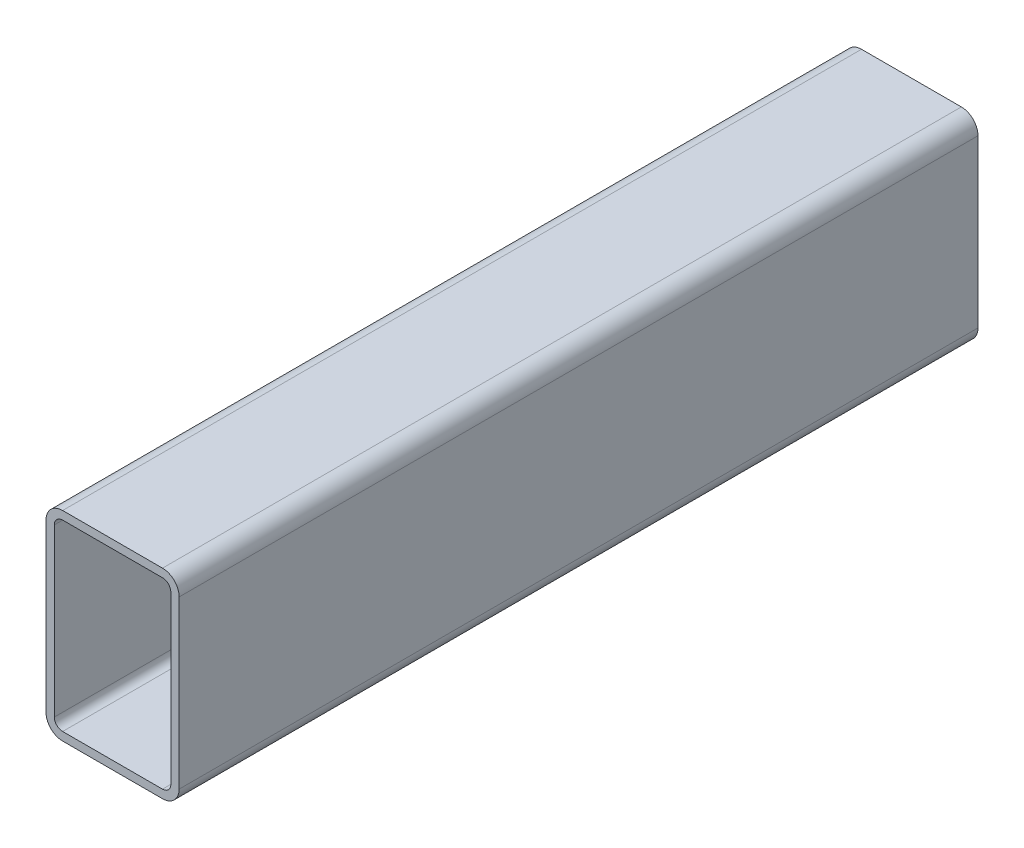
ISO-10303-21;
HEADER;
FILE_DESCRIPTION(('STEP AP214'),'2;1');
FILE_NAME('part.step','',(''),(''),'','','');
FILE_SCHEMA(('AUTOMOTIVE_DESIGN { 1 0 10303 214 1 1 1 1 }'));
ENDSEC;
DATA;
#1=APPLICATION_CONTEXT('core data for automotive mechanical design processes');
#2=APPLICATION_PROTOCOL_DEFINITION('international standard','automotive_design',2000,#1);
#3=PRODUCT_CONTEXT('',#1,'mechanical');
#4=PRODUCT('Part','Part','',(#3));
#5=PRODUCT_RELATED_PRODUCT_CATEGORY('part','',(#4));
#6=PRODUCT_DEFINITION_FORMATION('','',#4);
#7=PRODUCT_DEFINITION_CONTEXT('part definition',#1,'design');
#8=PRODUCT_DEFINITION('design','',#6,#7);
#9=PRODUCT_DEFINITION_SHAPE('','',#8);
#10=(LENGTH_UNIT() NAMED_UNIT(*) SI_UNIT(.MILLI.,.METRE.));
#11=(NAMED_UNIT(*) PLANE_ANGLE_UNIT() SI_UNIT($,.RADIAN.));
#12=(NAMED_UNIT(*) SI_UNIT($,.STERADIAN.) SOLID_ANGLE_UNIT());
#13=UNCERTAINTY_MEASURE_WITH_UNIT(LENGTH_MEASURE(1.E-05),#10,'distance_accuracy_value','');
#14=(GEOMETRIC_REPRESENTATION_CONTEXT(3) GLOBAL_UNCERTAINTY_ASSIGNED_CONTEXT((#13)) GLOBAL_UNIT_ASSIGNED_CONTEXT((#10,
#11,#12)) REPRESENTATION_CONTEXT('',''));
#15=CARTESIAN_POINT('',(0.,0.,0.));
#16=DIRECTION('',(0.,0.,1.));
#17=DIRECTION('',(1.,0.,0.));
#18=AXIS2_PLACEMENT_3D('',#15,#16,#17);
#19=CARTESIAN_POINT('',(6.35,69.85,304.8));
#20=DIRECTION('',(0.,0.,1.));
#21=DIRECTION('',(1.,0.,0.));
#22=AXIS2_PLACEMENT_3D('',#19,#20,#21);
#23=PLANE('',#22);
#24=CARTESIAN_POINT('',(6.35,69.85,304.8));
#25=DIRECTION('',(0.,0.,1.));
#26=DIRECTION('',(1.,0.,0.));
#27=AXIS2_PLACEMENT_3D('',#24,#25,#26);
#28=CIRCLE('',#27,6.35);
#29=CARTESIAN_POINT('',(6.35,76.2,304.8));
#30=VERTEX_POINT('',#29);
#31=CARTESIAN_POINT('',(0.,69.85,304.8));
#32=VERTEX_POINT('',#31);
#33=EDGE_CURVE('E211',#30,#32,#28,.T.);
#34=ORIENTED_EDGE('',*,*,#33,.T.);
#35=DIRECTION('',(0.,-1.,0.));
#36=VECTOR('',#35,1.);
#37=CARTESIAN_POINT('',(0.,6.35,304.8));
#38=LINE('',#37,#36);
#39=CARTESIAN_POINT('',(0.,6.35,304.8));
#40=VERTEX_POINT('',#39);
#41=EDGE_CURVE('E214',#32,#40,#38,.T.);
#42=ORIENTED_EDGE('',*,*,#41,.T.);
#43=CARTESIAN_POINT('',(6.35,6.35,304.8));
#44=DIRECTION('',(0.,0.,1.));
#45=DIRECTION('',(1.,0.,0.));
#46=AXIS2_PLACEMENT_3D('',#43,#44,#45);
#47=CIRCLE('',#46,6.35);
#48=CARTESIAN_POINT('',(6.35,0.,304.8));
#49=VERTEX_POINT('',#48);
#50=EDGE_CURVE('E217',#40,#49,#47,.T.);
#51=ORIENTED_EDGE('',*,*,#50,.T.);
#52=DIRECTION('',(1.,0.,0.));
#53=VECTOR('',#52,1.);
#54=CARTESIAN_POINT('',(44.45,0.,304.8));
#55=LINE('',#54,#53);
#56=CARTESIAN_POINT('',(44.45,0.,304.8));
#57=VERTEX_POINT('',#56);
#58=EDGE_CURVE('E219',#49,#57,#55,.T.);
#59=ORIENTED_EDGE('',*,*,#58,.T.);
#60=CARTESIAN_POINT('',(44.45,6.35,304.8));
#61=DIRECTION('',(0.,0.,1.));
#62=DIRECTION('',(1.,0.,0.));
#63=AXIS2_PLACEMENT_3D('',#60,#61,#62);
#64=CIRCLE('',#63,6.35);
#65=CARTESIAN_POINT('',(50.8,6.35,304.8));
#66=VERTEX_POINT('',#65);
#67=EDGE_CURVE('E221',#57,#66,#64,.T.);
#68=ORIENTED_EDGE('',*,*,#67,.T.);
#69=DIRECTION('',(0.,1.,0.));
#70=VECTOR('',#69,1.);
#71=CARTESIAN_POINT('',(50.8,69.85,304.8));
#72=LINE('',#71,#70);
#73=CARTESIAN_POINT('',(50.8,69.85,304.8));
#74=VERTEX_POINT('',#73);
#75=EDGE_CURVE('E223',#66,#74,#72,.T.);
#76=ORIENTED_EDGE('',*,*,#75,.T.);
#77=CARTESIAN_POINT('',(44.45,69.85,304.8));
#78=DIRECTION('',(0.,0.,1.));
#79=DIRECTION('',(1.,0.,0.));
#80=AXIS2_PLACEMENT_3D('',#77,#78,#79);
#81=CIRCLE('',#80,6.35000000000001);
#82=CARTESIAN_POINT('',(44.45,76.2,304.8));
#83=VERTEX_POINT('',#82);
#84=EDGE_CURVE('E225',#74,#83,#81,.T.);
#85=ORIENTED_EDGE('',*,*,#84,.T.);
#86=DIRECTION('',(-1.,0.,0.));
#87=VECTOR('',#86,1.);
#88=CARTESIAN_POINT('',(6.35,76.2,304.8));
#89=LINE('',#88,#87);
#90=EDGE_CURVE('E227',#83,#30,#89,.T.);
#91=ORIENTED_EDGE('',*,*,#90,.T.);
#92=EDGE_LOOP('',(#34,#42,#51,#59,#68,#76,#85,#91));
#93=FACE_BOUND('',#92,.T.);
#94=DIRECTION('',(0.,-1.,0.));
#95=VECTOR('',#94,1.);
#96=CARTESIAN_POINT('',(3.175,6.35,304.8));
#97=LINE('',#96,#95);
#98=CARTESIAN_POINT('',(3.175,69.85,304.8));
#99=VERTEX_POINT('',#98);
#100=CARTESIAN_POINT('',(3.175,6.35,304.8));
#101=VERTEX_POINT('',#100);
#102=EDGE_CURVE('E154',#99,#101,#97,.T.);
#103=ORIENTED_EDGE('',*,*,#102,.F.);
#104=CARTESIAN_POINT('',(6.35,69.85,304.8));
#105=DIRECTION('',(0.,0.,1.));
#106=DIRECTION('',(1.,0.,0.));
#107=AXIS2_PLACEMENT_3D('',#104,#105,#106);
#108=CIRCLE('',#107,3.175);
#109=CARTESIAN_POINT('',(6.35,73.025,304.8));
#110=VERTEX_POINT('',#109);
#111=EDGE_CURVE('E146',#110,#99,#108,.T.);
#112=ORIENTED_EDGE('',*,*,#111,.F.);
#113=DIRECTION('',(-1.,0.,0.));
#114=VECTOR('',#113,1.);
#115=CARTESIAN_POINT('',(6.35,73.025,304.8));
#116=LINE('',#115,#114);
#117=CARTESIAN_POINT('',(44.45,73.025,304.8));
#118=VERTEX_POINT('',#117);
#119=EDGE_CURVE('E179',#118,#110,#116,.T.);
#120=ORIENTED_EDGE('',*,*,#119,.F.);
#121=CARTESIAN_POINT('',(44.45,69.85,304.8));
#122=DIRECTION('',(0.,0.,1.));
#123=DIRECTION('',(1.,0.,0.));
#124=AXIS2_PLACEMENT_3D('',#121,#122,#123);
#125=CIRCLE('',#124,3.175);
#126=CARTESIAN_POINT('',(47.625,69.85,304.8));
#127=VERTEX_POINT('',#126);
#128=EDGE_CURVE('E177',#127,#118,#125,.T.);
#129=ORIENTED_EDGE('',*,*,#128,.F.);
#130=DIRECTION('',(0.,1.,0.));
#131=VECTOR('',#130,1.);
#132=CARTESIAN_POINT('',(47.625,69.85,304.8));
#133=LINE('',#132,#131);
#134=CARTESIAN_POINT('',(47.625,6.35,304.8));
#135=VERTEX_POINT('',#134);
#136=EDGE_CURVE('E175',#135,#127,#133,.T.);
#137=ORIENTED_EDGE('',*,*,#136,.F.);
#138=CARTESIAN_POINT('',(44.45,6.35,304.8));
#139=DIRECTION('',(0.,0.,1.));
#140=DIRECTION('',(1.,0.,0.));
#141=AXIS2_PLACEMENT_3D('',#138,#139,#140);
#142=CIRCLE('',#141,3.175);
#143=CARTESIAN_POINT('',(44.45,3.175,304.8));
#144=VERTEX_POINT('',#143);
#145=EDGE_CURVE('E173',#144,#135,#142,.T.);
#146=ORIENTED_EDGE('',*,*,#145,.F.);
#147=DIRECTION('',(1.,0.,0.));
#148=VECTOR('',#147,1.);
#149=CARTESIAN_POINT('',(44.45,3.175,304.8));
#150=LINE('',#149,#148);
#151=CARTESIAN_POINT('',(6.35,3.175,304.8));
#152=VERTEX_POINT('',#151);
#153=EDGE_CURVE('E169',#152,#144,#150,.T.);
#154=ORIENTED_EDGE('',*,*,#153,.F.);
#155=CARTESIAN_POINT('',(6.35,6.35,304.8));
#156=DIRECTION('',(0.,0.,1.));
#157=DIRECTION('',(1.,0.,0.));
#158=AXIS2_PLACEMENT_3D('',#155,#156,#157);
#159=CIRCLE('',#158,3.175);
#160=EDGE_CURVE('E167',#101,#152,#159,.T.);
#161=ORIENTED_EDGE('',*,*,#160,.F.);
#162=EDGE_LOOP('',(#103,#112,#120,#129,#137,#146,#154,#161));
#163=FACE_BOUND('',#162,.T.);
#164=ADVANCED_FACE('F33',(#93,#163),#23,.T.);
#165=CARTESIAN_POINT('',(6.35,69.85,0.));
#166=DIRECTION('',(0.,0.,1.));
#167=DIRECTION('',(1.,0.,0.));
#168=AXIS2_PLACEMENT_3D('',#165,#166,#167);
#169=PLANE('',#168);
#170=CARTESIAN_POINT('',(6.35,69.85,0.));
#171=DIRECTION('',(0.,0.,1.));
#172=DIRECTION('',(1.,0.,0.));
#173=AXIS2_PLACEMENT_3D('',#170,#171,#172);
#174=CIRCLE('',#173,6.35);
#175=CARTESIAN_POINT('',(6.35,76.2,0.));
#176=VERTEX_POINT('',#175);
#177=CARTESIAN_POINT('',(0.,69.85,0.));
#178=VERTEX_POINT('',#177);
#179=EDGE_CURVE('E162',#176,#178,#174,.T.);
#180=ORIENTED_EDGE('',*,*,#179,.F.);
#181=DIRECTION('',(-1.,0.,0.));
#182=VECTOR('',#181,1.);
#183=CARTESIAN_POINT('',(6.35,76.2,0.));
#184=LINE('',#183,#182);
#185=CARTESIAN_POINT('',(44.45,76.2,0.));
#186=VERTEX_POINT('',#185);
#187=EDGE_CURVE('E215',#186,#176,#184,.T.);
#188=ORIENTED_EDGE('',*,*,#187,.F.);
#189=CARTESIAN_POINT('',(44.45,69.85,0.));
#190=DIRECTION('',(0.,0.,1.));
#191=DIRECTION('',(1.,0.,0.));
#192=AXIS2_PLACEMENT_3D('',#189,#190,#191);
#193=CIRCLE('',#192,6.35000000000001);
#194=CARTESIAN_POINT('',(50.8,69.85,0.));
#195=VERTEX_POINT('',#194);
#196=EDGE_CURVE('E242',#195,#186,#193,.T.);
#197=ORIENTED_EDGE('',*,*,#196,.F.);
#198=DIRECTION('',(0.,1.,0.));
#199=VECTOR('',#198,1.);
#200=CARTESIAN_POINT('',(50.8,69.85,0.));
#201=LINE('',#200,#199);
#202=CARTESIAN_POINT('',(50.8,6.35,0.));
#203=VERTEX_POINT('',#202);
#204=EDGE_CURVE('E240',#203,#195,#201,.T.);
#205=ORIENTED_EDGE('',*,*,#204,.F.);
#206=CARTESIAN_POINT('',(44.45,6.35,0.));
#207=DIRECTION('',(0.,0.,1.));
#208=DIRECTION('',(1.,0.,0.));
#209=AXIS2_PLACEMENT_3D('',#206,#207,#208);
#210=CIRCLE('',#209,6.35);
#211=CARTESIAN_POINT('',(44.45,0.,0.));
#212=VERTEX_POINT('',#211);
#213=EDGE_CURVE('E238',#212,#203,#210,.T.);
#214=ORIENTED_EDGE('',*,*,#213,.F.);
#215=DIRECTION('',(1.,0.,0.));
#216=VECTOR('',#215,1.);
#217=CARTESIAN_POINT('',(44.45,0.,0.));
#218=LINE('',#217,#216);
#219=CARTESIAN_POINT('',(6.35,0.,0.));
#220=VERTEX_POINT('',#219);
#221=EDGE_CURVE('E236',#220,#212,#218,.T.);
#222=ORIENTED_EDGE('',*,*,#221,.F.);
#223=CARTESIAN_POINT('',(6.35,6.35,0.));
#224=DIRECTION('',(0.,0.,1.));
#225=DIRECTION('',(1.,0.,0.));
#226=AXIS2_PLACEMENT_3D('',#223,#224,#225);
#227=CIRCLE('',#226,6.35);
#228=CARTESIAN_POINT('',(0.,6.35,0.));
#229=VERTEX_POINT('',#228);
#230=EDGE_CURVE('E234',#229,#220,#227,.T.);
#231=ORIENTED_EDGE('',*,*,#230,.F.);
#232=DIRECTION('',(0.,-1.,0.));
#233=VECTOR('',#232,1.);
#234=CARTESIAN_POINT('',(0.,6.35,0.));
#235=LINE('',#234,#233);
#236=EDGE_CURVE('E232',#178,#229,#235,.T.);
#237=ORIENTED_EDGE('',*,*,#236,.F.);
#238=EDGE_LOOP('',(#180,#188,#197,#205,#214,#222,#231,#237));
#239=FACE_BOUND('',#238,.T.);
#240=CARTESIAN_POINT('',(6.35,69.85,0.));
#241=DIRECTION('',(0.,0.,1.));
#242=DIRECTION('',(1.,0.,0.));
#243=AXIS2_PLACEMENT_3D('',#240,#241,#242);
#244=CIRCLE('',#243,3.175);
#245=CARTESIAN_POINT('',(6.35,73.025,0.));
#246=VERTEX_POINT('',#245);
#247=CARTESIAN_POINT('',(3.175,69.85,0.));
#248=VERTEX_POINT('',#247);
#249=EDGE_CURVE('E56',#246,#248,#244,.T.);
#250=ORIENTED_EDGE('',*,*,#249,.T.);
#251=DIRECTION('',(0.,-1.,0.));
#252=VECTOR('',#251,1.);
#253=CARTESIAN_POINT('',(3.175,6.35,0.));
#254=LINE('',#253,#252);
#255=CARTESIAN_POINT('',(3.175,6.35,0.));
#256=VERTEX_POINT('',#255);
#257=EDGE_CURVE('E161',#248,#256,#254,.T.);
#258=ORIENTED_EDGE('',*,*,#257,.T.);
#259=CARTESIAN_POINT('',(6.35,6.35,0.));
#260=DIRECTION('',(0.,0.,1.));
#261=DIRECTION('',(1.,0.,0.));
#262=AXIS2_PLACEMENT_3D('',#259,#260,#261);
#263=CIRCLE('',#262,3.175);
#264=CARTESIAN_POINT('',(6.35,3.175,0.));
#265=VERTEX_POINT('',#264);
#266=EDGE_CURVE('E183',#256,#265,#263,.T.);
#267=ORIENTED_EDGE('',*,*,#266,.T.);
#268=DIRECTION('',(1.,0.,0.));
#269=VECTOR('',#268,1.);
#270=CARTESIAN_POINT('',(44.45,3.175,0.));
#271=LINE('',#270,#269);
#272=CARTESIAN_POINT('',(44.45,3.175,0.));
#273=VERTEX_POINT('',#272);
#274=EDGE_CURVE('E186',#265,#273,#271,.T.);
#275=ORIENTED_EDGE('',*,*,#274,.T.);
#276=CARTESIAN_POINT('',(44.45,6.35,0.));
#277=DIRECTION('',(0.,0.,1.));
#278=DIRECTION('',(1.,0.,0.));
#279=AXIS2_PLACEMENT_3D('',#276,#277,#278);
#280=CIRCLE('',#279,3.175);
#281=CARTESIAN_POINT('',(47.625,6.35,0.));
#282=VERTEX_POINT('',#281);
#283=EDGE_CURVE('E189',#273,#282,#280,.T.);
#284=ORIENTED_EDGE('',*,*,#283,.T.);
#285=DIRECTION('',(0.,1.,0.));
#286=VECTOR('',#285,1.);
#287=CARTESIAN_POINT('',(47.625,69.85,0.));
#288=LINE('',#287,#286);
#289=CARTESIAN_POINT('',(47.625,69.85,0.));
#290=VERTEX_POINT('',#289);
#291=EDGE_CURVE('E192',#282,#290,#288,.T.);
#292=ORIENTED_EDGE('',*,*,#291,.T.);
#293=CARTESIAN_POINT('',(44.45,69.85,0.));
#294=DIRECTION('',(0.,0.,1.));
#295=DIRECTION('',(1.,0.,0.));
#296=AXIS2_PLACEMENT_3D('',#293,#294,#295);
#297=CIRCLE('',#296,3.175);
#298=CARTESIAN_POINT('',(44.45,73.025,0.));
#299=VERTEX_POINT('',#298);
#300=EDGE_CURVE('E195',#290,#299,#297,.T.);
#301=ORIENTED_EDGE('',*,*,#300,.T.);
#302=DIRECTION('',(-1.,0.,0.));
#303=VECTOR('',#302,1.);
#304=CARTESIAN_POINT('',(6.35,73.025,0.));
#305=LINE('',#304,#303);
#306=EDGE_CURVE('E155',#299,#246,#305,.T.);
#307=ORIENTED_EDGE('',*,*,#306,.T.);
#308=EDGE_LOOP('',(#250,#258,#267,#275,#284,#292,#301,#307));
#309=FACE_BOUND('',#308,.T.);
#310=ADVANCED_FACE('F272',(#239,#309),#169,.F.);
#311=CARTESIAN_POINT('',(6.35,69.85,304.8));
#312=DIRECTION('',(0.,0.,-1.));
#313=DIRECTION('',(-1.,0.,0.));
#314=AXIS2_PLACEMENT_3D('',#311,#312,#313);
#315=CYLINDRICAL_SURFACE('',#314,6.35);
#316=ORIENTED_EDGE('',*,*,#179,.T.);
#317=DIRECTION('',(0.,0.,-1.));
#318=VECTOR('',#317,1.);
#319=CARTESIAN_POINT('',(0.,69.85,304.8));
#320=LINE('',#319,#318);
#321=EDGE_CURVE('E11',#32,#178,#320,.T.);
#322=ORIENTED_EDGE('',*,*,#321,.F.);
#323=ORIENTED_EDGE('',*,*,#33,.F.);
#324=DIRECTION('',(0.,0.,-1.));
#325=VECTOR('',#324,1.);
#326=CARTESIAN_POINT('',(6.35,76.2,304.8));
#327=LINE('',#326,#325);
#328=EDGE_CURVE('E229',#30,#176,#327,.T.);
#329=ORIENTED_EDGE('',*,*,#328,.T.);
#330=EDGE_LOOP('',(#316,#322,#323,#329));
#331=FACE_BOUND('',#330,.T.);
#332=ADVANCED_FACE('F35',(#331),#315,.T.);
#333=CARTESIAN_POINT('',(0.,6.35,304.8));
#334=DIRECTION('',(1.,0.,0.));
#335=DIRECTION('',(0.,0.,-1.));
#336=AXIS2_PLACEMENT_3D('',#333,#334,#335);
#337=PLANE('',#336);
#338=ORIENTED_EDGE('',*,*,#236,.T.);
#339=DIRECTION('',(0.,0.,-1.));
#340=VECTOR('',#339,1.);
#341=CARTESIAN_POINT('',(0.,6.35,304.8));
#342=LINE('',#341,#340);
#343=EDGE_CURVE('E41',#40,#229,#342,.T.);
#344=ORIENTED_EDGE('',*,*,#343,.F.);
#345=ORIENTED_EDGE('',*,*,#41,.F.);
#346=ORIENTED_EDGE('',*,*,#321,.T.);
#347=EDGE_LOOP('',(#338,#344,#345,#346));
#348=FACE_BOUND('',#347,.T.);
#349=ADVANCED_FACE('F289',(#348),#337,.F.);
#350=CARTESIAN_POINT('',(6.35,6.35,304.8));
#351=DIRECTION('',(0.,0.,-1.));
#352=DIRECTION('',(-1.,0.,0.));
#353=AXIS2_PLACEMENT_3D('',#350,#351,#352);
#354=CYLINDRICAL_SURFACE('',#353,6.35);
#355=ORIENTED_EDGE('',*,*,#230,.T.);
#356=DIRECTION('',(0.,0.,-1.));
#357=VECTOR('',#356,1.);
#358=CARTESIAN_POINT('',(6.35,0.,304.8));
#359=LINE('',#358,#357);
#360=EDGE_CURVE('E259',#49,#220,#359,.T.);
#361=ORIENTED_EDGE('',*,*,#360,.F.);
#362=ORIENTED_EDGE('',*,*,#50,.F.);
#363=ORIENTED_EDGE('',*,*,#343,.T.);
#364=EDGE_LOOP('',(#355,#361,#362,#363));
#365=FACE_BOUND('',#364,.T.);
#366=ADVANCED_FACE('F266',(#365),#354,.T.);
#367=CARTESIAN_POINT('',(44.45,0.,304.8));
#368=DIRECTION('',(0.,1.,0.));
#369=DIRECTION('',(0.,0.,1.));
#370=AXIS2_PLACEMENT_3D('',#367,#368,#369);
#371=PLANE('',#370);
#372=ORIENTED_EDGE('',*,*,#221,.T.);
#373=DIRECTION('',(0.,0.,-1.));
#374=VECTOR('',#373,1.);
#375=CARTESIAN_POINT('',(44.45,0.,304.8));
#376=LINE('',#375,#374);
#377=EDGE_CURVE('E256',#57,#212,#376,.T.);
#378=ORIENTED_EDGE('',*,*,#377,.F.);
#379=ORIENTED_EDGE('',*,*,#58,.F.);
#380=ORIENTED_EDGE('',*,*,#360,.T.);
#381=EDGE_LOOP('',(#372,#378,#379,#380));
#382=FACE_BOUND('',#381,.T.);
#383=ADVANCED_FACE('F278',(#382),#371,.F.);
#384=CARTESIAN_POINT('',(44.45,6.35,304.8));
#385=DIRECTION('',(0.,0.,-1.));
#386=DIRECTION('',(-1.,0.,0.));
#387=AXIS2_PLACEMENT_3D('',#384,#385,#386);
#388=CYLINDRICAL_SURFACE('',#387,6.35);
#389=ORIENTED_EDGE('',*,*,#213,.T.);
#390=DIRECTION('',(0.,0.,-1.));
#391=VECTOR('',#390,1.);
#392=CARTESIAN_POINT('',(50.8,6.35,304.8));
#393=LINE('',#392,#391);
#394=EDGE_CURVE('E253',#66,#203,#393,.T.);
#395=ORIENTED_EDGE('',*,*,#394,.F.);
#396=ORIENTED_EDGE('',*,*,#67,.F.);
#397=ORIENTED_EDGE('',*,*,#377,.T.);
#398=EDGE_LOOP('',(#389,#395,#396,#397));
#399=FACE_BOUND('',#398,.T.);
#400=ADVANCED_FACE('F282',(#399),#388,.T.);
#401=CARTESIAN_POINT('',(50.8,69.85,304.8));
#402=DIRECTION('',(-1.,0.,0.));
#403=DIRECTION('',(0.,0.,1.));
#404=AXIS2_PLACEMENT_3D('',#401,#402,#403);
#405=PLANE('',#404);
#406=ORIENTED_EDGE('',*,*,#204,.T.);
#407=DIRECTION('',(0.,0.,-1.));
#408=VECTOR('',#407,1.);
#409=CARTESIAN_POINT('',(50.8,69.85,304.8));
#410=LINE('',#409,#408);
#411=EDGE_CURVE('E250',#74,#195,#410,.T.);
#412=ORIENTED_EDGE('',*,*,#411,.F.);
#413=ORIENTED_EDGE('',*,*,#75,.F.);
#414=ORIENTED_EDGE('',*,*,#394,.T.);
#415=EDGE_LOOP('',(#406,#412,#413,#414));
#416=FACE_BOUND('',#415,.T.);
#417=ADVANCED_FACE('F302',(#416),#405,.F.);
#418=CARTESIAN_POINT('',(44.45,69.85,304.8));
#419=DIRECTION('',(0.,0.,-1.));
#420=DIRECTION('',(-1.,0.,0.));
#421=AXIS2_PLACEMENT_3D('',#418,#419,#420);
#422=CYLINDRICAL_SURFACE('',#421,6.35000000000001);
#423=ORIENTED_EDGE('',*,*,#196,.T.);
#424=DIRECTION('',(0.,0.,-1.));
#425=VECTOR('',#424,1.);
#426=CARTESIAN_POINT('',(44.45,76.2,304.8));
#427=LINE('',#426,#425);
#428=EDGE_CURVE('E247',#83,#186,#427,.T.);
#429=ORIENTED_EDGE('',*,*,#428,.F.);
#430=ORIENTED_EDGE('',*,*,#84,.F.);
#431=ORIENTED_EDGE('',*,*,#411,.T.);
#432=EDGE_LOOP('',(#423,#429,#430,#431));
#433=FACE_BOUND('',#432,.T.);
#434=ADVANCED_FACE('F300',(#433),#422,.T.);
#435=CARTESIAN_POINT('',(6.35,76.2,304.8));
#436=DIRECTION('',(0.,-1.,0.));
#437=DIRECTION('',(0.,0.,-1.));
#438=AXIS2_PLACEMENT_3D('',#435,#436,#437);
#439=PLANE('',#438);
#440=ORIENTED_EDGE('',*,*,#187,.T.);
#441=ORIENTED_EDGE('',*,*,#328,.F.);
#442=ORIENTED_EDGE('',*,*,#90,.F.);
#443=ORIENTED_EDGE('',*,*,#428,.T.);
#444=EDGE_LOOP('',(#440,#441,#442,#443));
#445=FACE_BOUND('',#444,.T.);
#446=ADVANCED_FACE('F295',(#445),#439,.F.);
#447=CARTESIAN_POINT('',(6.35,69.85,304.8));
#448=DIRECTION('',(0.,0.,-1.));
#449=DIRECTION('',(-1.,0.,0.));
#450=AXIS2_PLACEMENT_3D('',#447,#448,#449);
#451=CYLINDRICAL_SURFACE('',#450,3.175);
#452=ORIENTED_EDGE('',*,*,#249,.F.);
#453=DIRECTION('',(0.,0.,-1.));
#454=VECTOR('',#453,1.);
#455=CARTESIAN_POINT('',(6.35,73.025,304.8));
#456=LINE('',#455,#454);
#457=EDGE_CURVE('E150',#110,#246,#456,.T.);
#458=ORIENTED_EDGE('',*,*,#457,.F.);
#459=ORIENTED_EDGE('',*,*,#111,.T.);
#460=DIRECTION('',(0.,0.,-1.));
#461=VECTOR('',#460,1.);
#462=CARTESIAN_POINT('',(3.175,69.85,304.8));
#463=LINE('',#462,#461);
#464=EDGE_CURVE('E149',#99,#248,#463,.T.);
#465=ORIENTED_EDGE('',*,*,#464,.T.);
#466=EDGE_LOOP('',(#452,#458,#459,#465));
#467=FACE_BOUND('',#466,.T.);
#468=ADVANCED_FACE('F148',(#467),#451,.F.);
#469=CARTESIAN_POINT('',(3.175,6.35,304.8));
#470=DIRECTION('',(1.,0.,0.));
#471=DIRECTION('',(0.,0.,-1.));
#472=AXIS2_PLACEMENT_3D('',#469,#470,#471);
#473=PLANE('',#472);
#474=ORIENTED_EDGE('',*,*,#257,.F.);
#475=ORIENTED_EDGE('',*,*,#464,.F.);
#476=ORIENTED_EDGE('',*,*,#102,.T.);
#477=DIRECTION('',(0.,0.,-1.));
#478=VECTOR('',#477,1.);
#479=CARTESIAN_POINT('',(3.175,6.35,304.8));
#480=LINE('',#479,#478);
#481=EDGE_CURVE('E163',#101,#256,#480,.T.);
#482=ORIENTED_EDGE('',*,*,#481,.T.);
#483=EDGE_LOOP('',(#474,#475,#476,#482));
#484=FACE_BOUND('',#483,.T.);
#485=ADVANCED_FACE('F158',(#484),#473,.T.);
#486=CARTESIAN_POINT('',(6.35,6.35,304.8));
#487=DIRECTION('',(0.,0.,-1.));
#488=DIRECTION('',(-1.,0.,0.));
#489=AXIS2_PLACEMENT_3D('',#486,#487,#488);
#490=CYLINDRICAL_SURFACE('',#489,3.175);
#491=ORIENTED_EDGE('',*,*,#266,.F.);
#492=ORIENTED_EDGE('',*,*,#481,.F.);
#493=ORIENTED_EDGE('',*,*,#160,.T.);
#494=DIRECTION('',(0.,0.,-1.));
#495=VECTOR('',#494,1.);
#496=CARTESIAN_POINT('',(6.35,3.175,304.8));
#497=LINE('',#496,#495);
#498=EDGE_CURVE('E208',#152,#265,#497,.T.);
#499=ORIENTED_EDGE('',*,*,#498,.T.);
#500=EDGE_LOOP('',(#491,#492,#493,#499));
#501=FACE_BOUND('',#500,.T.);
#502=ADVANCED_FACE('F327',(#501),#490,.F.);
#503=CARTESIAN_POINT('',(44.45,3.175,304.8));
#504=DIRECTION('',(0.,1.,0.));
#505=DIRECTION('',(0.,0.,1.));
#506=AXIS2_PLACEMENT_3D('',#503,#504,#505);
#507=PLANE('',#506);
#508=ORIENTED_EDGE('',*,*,#274,.F.);
#509=ORIENTED_EDGE('',*,*,#498,.F.);
#510=ORIENTED_EDGE('',*,*,#153,.T.);
#511=DIRECTION('',(0.,0.,-1.));
#512=VECTOR('',#511,1.);
#513=CARTESIAN_POINT('',(44.45,3.175,304.8));
#514=LINE('',#513,#512);
#515=EDGE_CURVE('E206',#144,#273,#514,.T.);
#516=ORIENTED_EDGE('',*,*,#515,.T.);
#517=EDGE_LOOP('',(#508,#509,#510,#516));
#518=FACE_BOUND('',#517,.T.);
#519=ADVANCED_FACE('F331',(#518),#507,.T.);
#520=CARTESIAN_POINT('',(44.45,6.35,304.8));
#521=DIRECTION('',(0.,0.,-1.));
#522=DIRECTION('',(-1.,0.,0.));
#523=AXIS2_PLACEMENT_3D('',#520,#521,#522);
#524=CYLINDRICAL_SURFACE('',#523,3.175);
#525=ORIENTED_EDGE('',*,*,#283,.F.);
#526=ORIENTED_EDGE('',*,*,#515,.F.);
#527=ORIENTED_EDGE('',*,*,#145,.T.);
#528=DIRECTION('',(0.,0.,-1.));
#529=VECTOR('',#528,1.);
#530=CARTESIAN_POINT('',(47.625,6.35,304.8));
#531=LINE('',#530,#529);
#532=EDGE_CURVE('E204',#135,#282,#531,.T.);
#533=ORIENTED_EDGE('',*,*,#532,.T.);
#534=EDGE_LOOP('',(#525,#526,#527,#533));
#535=FACE_BOUND('',#534,.T.);
#536=ADVANCED_FACE('F337',(#535),#524,.F.);
#537=CARTESIAN_POINT('',(47.625,69.85,304.8));
#538=DIRECTION('',(-1.,0.,0.));
#539=DIRECTION('',(0.,0.,1.));
#540=AXIS2_PLACEMENT_3D('',#537,#538,#539);
#541=PLANE('',#540);
#542=ORIENTED_EDGE('',*,*,#291,.F.);
#543=ORIENTED_EDGE('',*,*,#532,.F.);
#544=ORIENTED_EDGE('',*,*,#136,.T.);
#545=DIRECTION('',(0.,0.,-1.));
#546=VECTOR('',#545,1.);
#547=CARTESIAN_POINT('',(47.625,69.85,304.8));
#548=LINE('',#547,#546);
#549=EDGE_CURVE('E202',#127,#290,#548,.T.);
#550=ORIENTED_EDGE('',*,*,#549,.T.);
#551=EDGE_LOOP('',(#542,#543,#544,#550));
#552=FACE_BOUND('',#551,.T.);
#553=ADVANCED_FACE('F341',(#552),#541,.T.);
#554=CARTESIAN_POINT('',(44.45,69.85,304.8));
#555=DIRECTION('',(0.,0.,-1.));
#556=DIRECTION('',(-1.,0.,0.));
#557=AXIS2_PLACEMENT_3D('',#554,#555,#556);
#558=CYLINDRICAL_SURFACE('',#557,3.175);
#559=ORIENTED_EDGE('',*,*,#300,.F.);
#560=ORIENTED_EDGE('',*,*,#549,.F.);
#561=ORIENTED_EDGE('',*,*,#128,.T.);
#562=DIRECTION('',(0.,0.,-1.));
#563=VECTOR('',#562,1.);
#564=CARTESIAN_POINT('',(44.45,73.025,304.8));
#565=LINE('',#564,#563);
#566=EDGE_CURVE('E48',#118,#299,#565,.T.);
#567=ORIENTED_EDGE('',*,*,#566,.T.);
#568=EDGE_LOOP('',(#559,#560,#561,#567));
#569=FACE_BOUND('',#568,.T.);
#570=ADVANCED_FACE('F345',(#569),#558,.F.);
#571=CARTESIAN_POINT('',(6.35,73.025,304.8));
#572=DIRECTION('',(0.,-1.,0.));
#573=DIRECTION('',(0.,0.,-1.));
#574=AXIS2_PLACEMENT_3D('',#571,#572,#573);
#575=PLANE('',#574);
#576=ORIENTED_EDGE('',*,*,#306,.F.);
#577=ORIENTED_EDGE('',*,*,#566,.F.);
#578=ORIENTED_EDGE('',*,*,#119,.T.);
#579=ORIENTED_EDGE('',*,*,#457,.T.);
#580=EDGE_LOOP('',(#576,#577,#578,#579));
#581=FACE_BOUND('',#580,.T.);
#582=ADVANCED_FACE('F349',(#581),#575,.T.);
#583=CLOSED_SHELL('',(#164,#310,#332,#349,#366,#383,#400,#417,#434,#446,#468,#485,#502,#519,
#536,#553,#570,#582));
#584=MANIFOLD_SOLID_BREP('B2',#583);
#585=ADVANCED_BREP_SHAPE_REPRESENTATION('',(#18,#584),#14);
#586=SHAPE_DEFINITION_REPRESENTATION(#9,#585);
ENDSEC;
END-ISO-10303-21;
